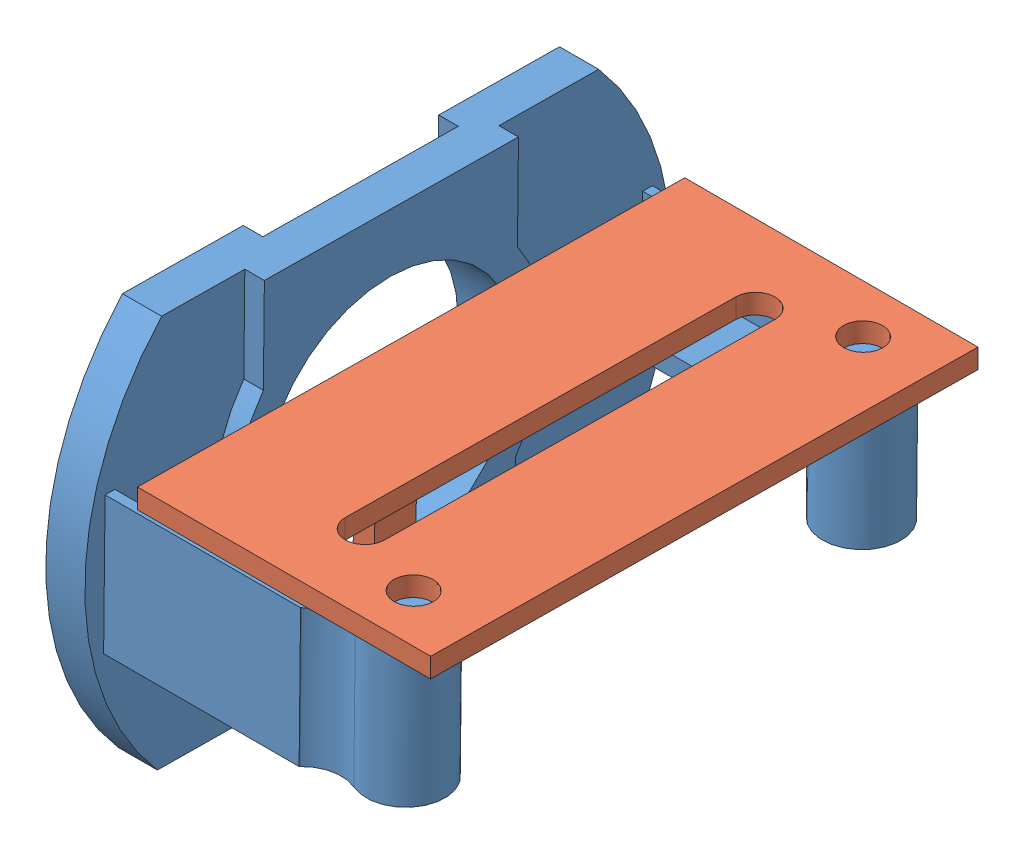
SolidWorks assembly moteur_codeur.SLDASM, configuration Défaut (file format 14000). Lengths in mm.
Overall size (79.98 38.03 38.03).
3 component instances, 3 part files, 5 mates.
Components (placement in the parent):
- stator_moteur-1: stator_moteur.SLDPRT [Default] at (-41.7247 1.9062 0) size (69.2 38.03 38.03)
- support_codeur-1: support_codeur.SLDPRT [Défaut] at (32.5753 4.8717 -0.4535) x (0 -0.010753 -0.999942) z (0 -0.999942 0.010753) size (30 17.1 20)
- Circuit_codeur-1: Circuit_codeur.SLDPRT [Défaut] at (34.0524 6.0204 13.3663) x (0 -0.010753 -0.999942) z (0 -0.999942 0.010753) size (28 15 4)
Mates (geometry in assembly coordinates):
- Coaxiale1: concentric anti-aligned: cylinder of stator_moteur-1 through (32.5753 1.9062 0) axis (1 0 0) radius 6.5; cylinder of support_codeur-1 through (33.5753 1.9062 0) axis (-1 0 0) radius 6.5
- Coïncidente1: coincident anti-aligned: plane of stator_moteur-1 through (30.5753 -15.6109 -17.6803) normal (1 0 0); plane of support_codeur-1 through (30.5753 1.3719 -0.4159) normal (-1 0 0)
- Coaxiale8: concentric aligned: cylinder of support_codeur-1 through (45.6778 -2.2534 -12.0463) axis (0 0.999942 -0.010753) radius 2; cylinder of circuit_codeur-1 through (45.6778 4.7462 -12.1215) axis (0 0.999942 -0.010753) radius 1
- Coïncidente3: coincident anti-aligned: plane of support_codeur-1 through (45.6778 4.7462 -12.1215) normal (0 0.999942 -0.010753); plane of circuit_codeur-1 through (34.0524 5.0204 13.377) normal (0 -0.999942 0.010753)
- Parallèle1: parallel aligned: plane of support_codeur-1 through (33.5753 1.9062 0) normal (1 0 0); plane of circuit_codeur-1 through (40.6778 4.7624 -10.6216) normal (1 0 0)
